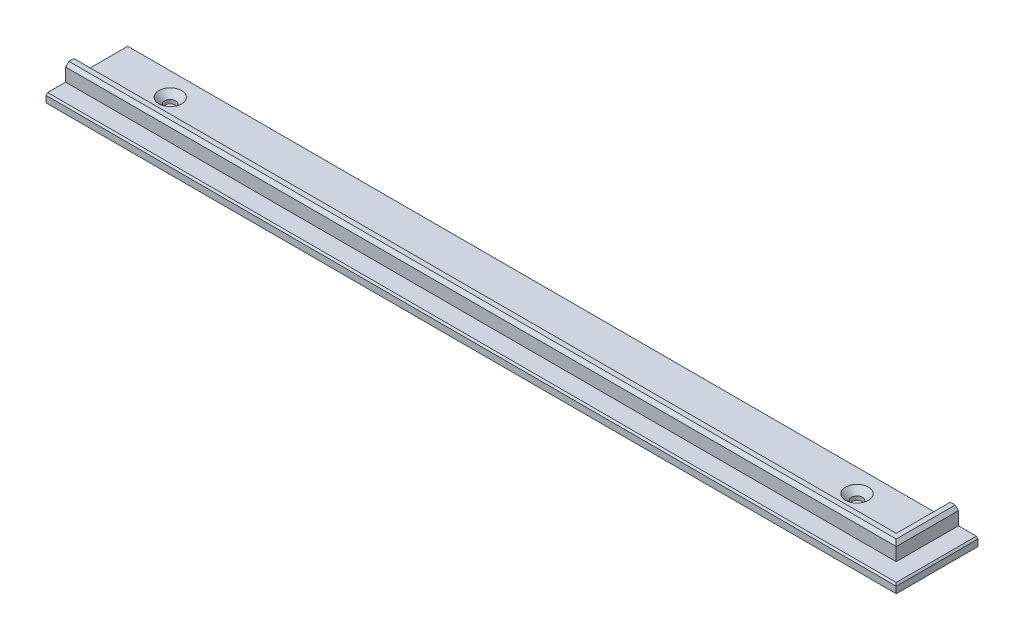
ISO-10303-21;
HEADER;
FILE_DESCRIPTION(('STEP AP214'),'2;1');
FILE_NAME('part.step','',(''),(''),'','','');
FILE_SCHEMA(('AUTOMOTIVE_DESIGN { 1 0 10303 214 1 1 1 1 }'));
ENDSEC;
DATA;
#1=APPLICATION_CONTEXT('core data for automotive mechanical design processes');
#2=APPLICATION_PROTOCOL_DEFINITION('international standard','automotive_design',2000,#1);
#3=PRODUCT_CONTEXT('',#1,'mechanical');
#4=PRODUCT('Part','Part','',(#3));
#5=PRODUCT_RELATED_PRODUCT_CATEGORY('part','',(#4));
#6=PRODUCT_DEFINITION_FORMATION('','',#4);
#7=PRODUCT_DEFINITION_CONTEXT('part definition',#1,'design');
#8=PRODUCT_DEFINITION('design','',#6,#7);
#9=PRODUCT_DEFINITION_SHAPE('','',#8);
#10=(LENGTH_UNIT() NAMED_UNIT(*) SI_UNIT(.MILLI.,.METRE.));
#11=(NAMED_UNIT(*) PLANE_ANGLE_UNIT() SI_UNIT($,.RADIAN.));
#12=(NAMED_UNIT(*) SI_UNIT($,.STERADIAN.) SOLID_ANGLE_UNIT());
#13=UNCERTAINTY_MEASURE_WITH_UNIT(LENGTH_MEASURE(1.E-05),#10,'distance_accuracy_value','');
#14=(GEOMETRIC_REPRESENTATION_CONTEXT(3) GLOBAL_UNCERTAINTY_ASSIGNED_CONTEXT((#13)) GLOBAL_UNIT_ASSIGNED_CONTEXT((#10,
#11,#12)) REPRESENTATION_CONTEXT('',''));
#15=CARTESIAN_POINT('',(0.,0.,0.));
#16=DIRECTION('',(0.,0.,1.));
#17=DIRECTION('',(1.,0.,0.));
#18=AXIS2_PLACEMENT_3D('',#15,#16,#17);
#19=CARTESIAN_POINT('',(0.,3.,0.));
#20=DIRECTION('',(0.,-1.,0.));
#21=DIRECTION('',(0.,0.,-1.));
#22=AXIS2_PLACEMENT_3D('',#19,#20,#21);
#23=PLANE('',#22);
#24=CARTESIAN_POINT('',(100.,3.,-5.5));
#25=DIRECTION('',(0.,1.,0.));
#26=DIRECTION('',(0.,0.,1.));
#27=AXIS2_PLACEMENT_3D('',#24,#25,#26);
#28=CIRCLE('',#27,3.5);
#29=CARTESIAN_POINT('',(100.,3.,-1.99999999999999));
#30=VERTEX_POINT('',#29);
#31=EDGE_CURVE('E402',#30,#30,#28,.T.);
#32=ORIENTED_EDGE('',*,*,#31,.F.);
#33=EDGE_LOOP('',(#32));
#34=FACE_BOUND('',#33,.T.);
#35=CARTESIAN_POINT('',(-110.,3.,-5.5));
#36=DIRECTION('',(0.,1.,0.));
#37=DIRECTION('',(0.,0.,1.));
#38=AXIS2_PLACEMENT_3D('',#35,#36,#37);
#39=CIRCLE('',#38,3.5);
#40=CARTESIAN_POINT('',(-110.,3.,-1.99999999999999));
#41=VERTEX_POINT('',#40);
#42=EDGE_CURVE('E390',#41,#41,#39,.T.);
#43=ORIENTED_EDGE('',*,*,#42,.F.);
#44=EDGE_LOOP('',(#43));
#45=FACE_BOUND('',#44,.T.);
#46=DIRECTION('',(-1.,0.,0.));
#47=VECTOR('',#46,1.);
#48=CARTESIAN_POINT('',(-130.,3.,3.5));
#49=LINE('',#48,#47);
#50=CARTESIAN_POINT('',(121.,3.,3.5));
#51=VERTEX_POINT('',#50);
#52=CARTESIAN_POINT('',(-130.,3.,3.5));
#53=VERTEX_POINT('',#52);
#54=EDGE_CURVE('E193',#51,#53,#49,.T.);
#55=ORIENTED_EDGE('',*,*,#54,.F.);
#56=DIRECTION('',(0.,0.,1.));
#57=VECTOR('',#56,1.);
#58=CARTESIAN_POINT('',(121.,3.,-12.5));
#59=LINE('',#58,#57);
#60=CARTESIAN_POINT('',(121.,3.,-12.5));
#61=VERTEX_POINT('',#60);
#62=EDGE_CURVE('E175',#61,#51,#59,.T.);
#63=ORIENTED_EDGE('',*,*,#62,.F.);
#64=DIRECTION('',(-1.,0.,0.));
#65=VECTOR('',#64,1.);
#66=CARTESIAN_POINT('',(-130.,3.,-12.5));
#67=LINE('',#66,#65);
#68=CARTESIAN_POINT('',(-130.,3.,-12.5));
#69=VERTEX_POINT('',#68);
#70=EDGE_CURVE('E211',#61,#69,#67,.T.);
#71=ORIENTED_EDGE('',*,*,#70,.T.);
#72=DIRECTION('',(0.,0.,1.));
#73=VECTOR('',#72,1.);
#74=CARTESIAN_POINT('',(-130.,3.,12.5));
#75=LINE('',#74,#73);
#76=EDGE_CURVE('E215',#69,#53,#75,.T.);
#77=ORIENTED_EDGE('',*,*,#76,.T.);
#78=EDGE_LOOP('',(#55,#63,#71,#77));
#79=FACE_BOUND('',#78,.T.);
#80=ADVANCED_FACE('F40',(#34,#45,#79),#23,.F.);
#81=CARTESIAN_POINT('',(-130.,3.,6.5));
#82=VERTEX_POINT('',#81);
#83=CARTESIAN_POINT('',(-130.,3.,12.));
#84=VERTEX_POINT('',#83);
#85=EDGE_CURVE('E214',#82,#84,#75,.T.);
#86=ORIENTED_EDGE('',*,*,#85,.T.);
#87=DIRECTION('',(1.,0.,0.));
#88=VECTOR('',#87,1.);
#89=CARTESIAN_POINT('',(0.,3.,12.));
#90=LINE('',#89,#88);
#91=CARTESIAN_POINT('',(129.5,3.,12.));
#92=VERTEX_POINT('',#91);
#93=EDGE_CURVE('E283',#84,#92,#90,.T.);
#94=ORIENTED_EDGE('',*,*,#93,.T.);
#95=DIRECTION('',(0.,0.,-1.));
#96=VECTOR('',#95,1.);
#97=CARTESIAN_POINT('',(129.5,3.,0.));
#98=LINE('',#97,#96);
#99=CARTESIAN_POINT('',(129.5,3.,-12.5));
#100=VERTEX_POINT('',#99);
#101=EDGE_CURVE('E280',#92,#100,#98,.T.);
#102=ORIENTED_EDGE('',*,*,#101,.T.);
#103=CARTESIAN_POINT('',(124.,3.,-12.5));
#104=VERTEX_POINT('',#103);
#105=EDGE_CURVE('E173',#100,#104,#67,.T.);
#106=ORIENTED_EDGE('',*,*,#105,.T.);
#107=DIRECTION('',(0.,0.,-1.));
#108=VECTOR('',#107,1.);
#109=CARTESIAN_POINT('',(124.,3.,-12.5));
#110=LINE('',#109,#108);
#111=CARTESIAN_POINT('',(124.,3.,6.5));
#112=VERTEX_POINT('',#111);
#113=EDGE_CURVE('E159',#112,#104,#110,.T.);
#114=ORIENTED_EDGE('',*,*,#113,.F.);
#115=DIRECTION('',(1.,0.,0.));
#116=VECTOR('',#115,1.);
#117=CARTESIAN_POINT('',(-130.,3.,6.5));
#118=LINE('',#117,#116);
#119=EDGE_CURVE('E170',#82,#112,#118,.T.);
#120=ORIENTED_EDGE('',*,*,#119,.F.);
#121=EDGE_LOOP('',(#86,#94,#102,#106,#114,#120));
#122=FACE_BOUND('',#121,.T.);
#123=ADVANCED_FACE('F169',(#122),#23,.F.);
#124=CARTESIAN_POINT('',(130.,3.,12.5));
#125=DIRECTION('',(-1.,0.,0.));
#126=DIRECTION('',(0.,0.,1.));
#127=AXIS2_PLACEMENT_3D('',#124,#125,#126);
#128=PLANE('',#127);
#129=DIRECTION('',(0.,-1.,0.));
#130=VECTOR('',#129,1.);
#131=CARTESIAN_POINT('',(130.,3.,12.5));
#132=LINE('',#131,#130);
#133=CARTESIAN_POINT('',(130.,2.5,12.5));
#134=VERTEX_POINT('',#133);
#135=CARTESIAN_POINT('',(130.,0.500000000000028,12.5));
#136=VERTEX_POINT('',#135);
#137=EDGE_CURVE('E219',#134,#136,#132,.T.);
#138=ORIENTED_EDGE('',*,*,#137,.T.);
#139=DIRECTION('',(0.,0.,-1.));
#140=VECTOR('',#139,1.);
#141=CARTESIAN_POINT('',(130.,0.500000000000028,-12.5));
#142=LINE('',#141,#140);
#143=CARTESIAN_POINT('',(130.,0.500000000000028,-12.5));
#144=VERTEX_POINT('',#143);
#145=EDGE_CURVE('E277',#136,#144,#142,.T.);
#146=ORIENTED_EDGE('',*,*,#145,.T.);
#147=DIRECTION('',(0.,-1.,0.));
#148=VECTOR('',#147,1.);
#149=CARTESIAN_POINT('',(130.,3.,-12.5));
#150=LINE('',#149,#148);
#151=CARTESIAN_POINT('',(130.,2.5,-12.5));
#152=VERTEX_POINT('',#151);
#153=EDGE_CURVE('E231',#152,#144,#150,.T.);
#154=ORIENTED_EDGE('',*,*,#153,.F.);
#155=DIRECTION('',(0.,0.,1.));
#156=VECTOR('',#155,1.);
#157=CARTESIAN_POINT('',(130.,2.5,12.5));
#158=LINE('',#157,#156);
#159=EDGE_CURVE('E274',#152,#134,#158,.T.);
#160=ORIENTED_EDGE('',*,*,#159,.T.);
#161=EDGE_LOOP('',(#138,#146,#154,#160));
#162=FACE_BOUND('',#161,.T.);
#163=ADVANCED_FACE('F475',(#162),#128,.F.);
#164=CARTESIAN_POINT('',(-130.,3.,-12.5));
#165=DIRECTION('',(0.,0.,1.));
#166=DIRECTION('',(1.,0.,0.));
#167=AXIS2_PLACEMENT_3D('',#164,#165,#166);
#168=PLANE('',#167);
#169=DIRECTION('',(-1.,0.,0.));
#170=VECTOR('',#169,1.);
#171=CARTESIAN_POINT('',(124.,8.,-12.5));
#172=LINE('',#171,#170);
#173=CARTESIAN_POINT('',(123.,8.,-12.5));
#174=VERTEX_POINT('',#173);
#175=CARTESIAN_POINT('',(121.5,8.,-12.5));
#176=VERTEX_POINT('',#175);
#177=EDGE_CURVE('E187',#174,#176,#172,.T.);
#178=ORIENTED_EDGE('',*,*,#177,.F.);
#179=DIRECTION('',(0.707106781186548,-0.707106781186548,0.));
#180=VECTOR('',#179,1.);
#181=CARTESIAN_POINT('',(123.,8.,-12.5));
#182=LINE('',#181,#180);
#183=CARTESIAN_POINT('',(124.,7.,-12.5));
#184=VERTEX_POINT('',#183);
#185=EDGE_CURVE('E322',#174,#184,#182,.T.);
#186=ORIENTED_EDGE('',*,*,#185,.T.);
#187=DIRECTION('',(0.,-1.,0.));
#188=VECTOR('',#187,1.);
#189=CARTESIAN_POINT('',(124.,8.,-12.5));
#190=LINE('',#189,#188);
#191=EDGE_CURVE('E163',#184,#104,#190,.T.);
#192=ORIENTED_EDGE('',*,*,#191,.T.);
#193=ORIENTED_EDGE('',*,*,#105,.F.);
#194=DIRECTION('',(-0.707106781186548,0.707106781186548,0.));
#195=VECTOR('',#194,1.);
#196=CARTESIAN_POINT('',(129.5,3.,-12.5));
#197=LINE('',#196,#195);
#198=EDGE_CURVE('E239',#100,#152,#197,.F.);
#199=ORIENTED_EDGE('',*,*,#198,.T.);
#200=ORIENTED_EDGE('',*,*,#153,.T.);
#201=DIRECTION('',(-1.,0.,0.));
#202=VECTOR('',#201,1.);
#203=CARTESIAN_POINT('',(-130.,0.500000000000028,-12.5));
#204=LINE('',#203,#202);
#205=CARTESIAN_POINT('',(-130.,0.500000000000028,-12.5));
#206=VERTEX_POINT('',#205);
#207=EDGE_CURVE('E242',#144,#206,#204,.T.);
#208=ORIENTED_EDGE('',*,*,#207,.T.);
#209=DIRECTION('',(0.,-1.,0.));
#210=VECTOR('',#209,1.);
#211=CARTESIAN_POINT('',(-130.,3.,-12.5));
#212=LINE('',#211,#210);
#213=EDGE_CURVE('E227',#69,#206,#212,.T.);
#214=ORIENTED_EDGE('',*,*,#213,.F.);
#215=ORIENTED_EDGE('',*,*,#70,.F.);
#216=DIRECTION('',(0.,-1.,0.));
#217=VECTOR('',#216,1.);
#218=CARTESIAN_POINT('',(121.,8.,-12.5));
#219=LINE('',#218,#217);
#220=CARTESIAN_POINT('',(121.,7.49999999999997,-12.5));
#221=VERTEX_POINT('',#220);
#222=EDGE_CURVE('E204',#221,#61,#219,.T.);
#223=ORIENTED_EDGE('',*,*,#222,.F.);
#224=DIRECTION('',(0.707106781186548,0.707106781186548,0.));
#225=VECTOR('',#224,1.);
#226=CARTESIAN_POINT('',(121.5,8.,-12.5));
#227=LINE('',#226,#225);
#228=EDGE_CURVE('E235',#221,#176,#227,.T.);
#229=ORIENTED_EDGE('',*,*,#228,.T.);
#230=EDGE_LOOP('',(#178,#186,#192,#193,#199,#200,#208,#214,#215,#223,#229));
#231=FACE_BOUND('',#230,.T.);
#232=ADVANCED_FACE('F429',(#231),#168,.F.);
#233=CARTESIAN_POINT('',(-130.,3.,12.5));
#234=DIRECTION('',(1.,0.,0.));
#235=DIRECTION('',(0.,0.,-1.));
#236=AXIS2_PLACEMENT_3D('',#233,#234,#235);
#237=PLANE('',#236);
#238=DIRECTION('',(0.,-1.,0.));
#239=VECTOR('',#238,1.);
#240=CARTESIAN_POINT('',(-130.,8.,6.5));
#241=LINE('',#240,#239);
#242=CARTESIAN_POINT('',(-130.,7.,6.5));
#243=VERTEX_POINT('',#242);
#244=EDGE_CURVE('E162',#243,#82,#241,.T.);
#245=ORIENTED_EDGE('',*,*,#244,.F.);
#246=DIRECTION('',(0.,0.707106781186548,-0.707106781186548));
#247=VECTOR('',#246,1.);
#248=CARTESIAN_POINT('',(-130.,8.,5.5));
#249=LINE('',#248,#247);
#250=CARTESIAN_POINT('',(-130.,8.,5.5));
#251=VERTEX_POINT('',#250);
#252=EDGE_CURVE('E11',#243,#251,#249,.T.);
#253=ORIENTED_EDGE('',*,*,#252,.T.);
#254=DIRECTION('',(0.,0.,1.));
#255=VECTOR('',#254,1.);
#256=CARTESIAN_POINT('',(-130.,8.,3.5));
#257=LINE('',#256,#255);
#258=CARTESIAN_POINT('',(-130.,8.,4.00000000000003));
#259=VERTEX_POINT('',#258);
#260=EDGE_CURVE('E197',#259,#251,#257,.T.);
#261=ORIENTED_EDGE('',*,*,#260,.F.);
#262=DIRECTION('',(0.,-0.707106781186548,-0.707106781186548));
#263=VECTOR('',#262,1.);
#264=CARTESIAN_POINT('',(-130.,8.,4.00000000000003));
#265=LINE('',#264,#263);
#266=CARTESIAN_POINT('',(-130.,7.49999999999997,3.5));
#267=VERTEX_POINT('',#266);
#268=EDGE_CURVE('E259',#259,#267,#265,.T.);
#269=ORIENTED_EDGE('',*,*,#268,.T.);
#270=DIRECTION('',(0.,-1.,0.));
#271=VECTOR('',#270,1.);
#272=CARTESIAN_POINT('',(-130.,8.,3.5));
#273=LINE('',#272,#271);
#274=EDGE_CURVE('E198',#267,#53,#273,.T.);
#275=ORIENTED_EDGE('',*,*,#274,.T.);
#276=ORIENTED_EDGE('',*,*,#76,.F.);
#277=ORIENTED_EDGE('',*,*,#213,.T.);
#278=DIRECTION('',(0.,0.,1.));
#279=VECTOR('',#278,1.);
#280=CARTESIAN_POINT('',(-130.,0.500000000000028,12.5));
#281=LINE('',#280,#279);
#282=CARTESIAN_POINT('',(-130.,0.500000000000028,12.5));
#283=VERTEX_POINT('',#282);
#284=EDGE_CURVE('E265',#206,#283,#281,.T.);
#285=ORIENTED_EDGE('',*,*,#284,.T.);
#286=DIRECTION('',(0.,-1.,0.));
#287=VECTOR('',#286,1.);
#288=CARTESIAN_POINT('',(-130.,3.,12.5));
#289=LINE('',#288,#287);
#290=CARTESIAN_POINT('',(-130.,2.5,12.5));
#291=VERTEX_POINT('',#290);
#292=EDGE_CURVE('E223',#291,#283,#289,.T.);
#293=ORIENTED_EDGE('',*,*,#292,.F.);
#294=DIRECTION('',(0.,-0.707106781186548,0.707106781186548));
#295=VECTOR('',#294,1.);
#296=CARTESIAN_POINT('',(-130.,3.,12.));
#297=LINE('',#296,#295);
#298=EDGE_CURVE('E262',#291,#84,#297,.F.);
#299=ORIENTED_EDGE('',*,*,#298,.T.);
#300=ORIENTED_EDGE('',*,*,#85,.F.);
#301=EDGE_LOOP('',(#245,#253,#261,#269,#275,#276,#277,#285,#293,#299,#300));
#302=FACE_BOUND('',#301,.T.);
#303=ADVANCED_FACE('F458',(#302),#237,.F.);
#304=CARTESIAN_POINT('',(-130.,3.,12.5));
#305=DIRECTION('',(0.,0.,-1.));
#306=DIRECTION('',(-1.,0.,0.));
#307=AXIS2_PLACEMENT_3D('',#304,#305,#306);
#308=PLANE('',#307);
#309=ORIENTED_EDGE('',*,*,#292,.T.);
#310=DIRECTION('',(1.,0.,0.));
#311=VECTOR('',#310,1.);
#312=CARTESIAN_POINT('',(130.,0.500000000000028,12.5));
#313=LINE('',#312,#311);
#314=EDGE_CURVE('E271',#283,#136,#313,.T.);
#315=ORIENTED_EDGE('',*,*,#314,.T.);
#316=ORIENTED_EDGE('',*,*,#137,.F.);
#317=DIRECTION('',(-1.,0.,0.));
#318=VECTOR('',#317,1.);
#319=CARTESIAN_POINT('',(-130.,2.5,12.5));
#320=LINE('',#319,#318);
#321=EDGE_CURVE('E268',#134,#291,#320,.T.);
#322=ORIENTED_EDGE('',*,*,#321,.T.);
#323=EDGE_LOOP('',(#309,#315,#316,#322));
#324=FACE_BOUND('',#323,.T.);
#325=ADVANCED_FACE('F630',(#324),#308,.F.);
#326=CARTESIAN_POINT('',(0.,0.,0.));
#327=DIRECTION('',(0.,-1.,0.));
#328=DIRECTION('',(0.,0.,-1.));
#329=AXIS2_PLACEMENT_3D('',#326,#327,#328);
#330=PLANE('',#329);
#331=CARTESIAN_POINT('',(100.,0.,-5.5));
#332=DIRECTION('',(0.,1.,0.));
#333=DIRECTION('',(0.,0.,1.));
#334=AXIS2_PLACEMENT_3D('',#331,#332,#333);
#335=CIRCLE('',#334,1.69999999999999);
#336=CARTESIAN_POINT('',(100.,0.,-3.8));
#337=VERTEX_POINT('',#336);
#338=EDGE_CURVE('E394',#337,#337,#335,.T.);
#339=ORIENTED_EDGE('',*,*,#338,.T.);
#340=EDGE_LOOP('',(#339));
#341=FACE_BOUND('',#340,.T.);
#342=CARTESIAN_POINT('',(-110.,0.,-5.5));
#343=DIRECTION('',(0.,1.,0.));
#344=DIRECTION('',(0.,0.,1.));
#345=AXIS2_PLACEMENT_3D('',#342,#343,#344);
#346=CIRCLE('',#345,1.69999999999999);
#347=CARTESIAN_POINT('',(-110.,0.,-3.8));
#348=VERTEX_POINT('',#347);
#349=EDGE_CURVE('E382',#348,#348,#346,.T.);
#350=ORIENTED_EDGE('',*,*,#349,.T.);
#351=EDGE_LOOP('',(#350));
#352=FACE_BOUND('',#351,.T.);
#353=DIRECTION('',(0.,0.,-1.));
#354=VECTOR('',#353,1.);
#355=CARTESIAN_POINT('',(-129.5,0.,-12.5));
#356=LINE('',#355,#354);
#357=CARTESIAN_POINT('',(-129.5,0.,12.));
#358=VERTEX_POINT('',#357);
#359=CARTESIAN_POINT('',(-129.5,0.,-12.));
#360=VERTEX_POINT('',#359);
#361=EDGE_CURVE('E252',#358,#360,#356,.T.);
#362=ORIENTED_EDGE('',*,*,#361,.T.);
#363=DIRECTION('',(1.,0.,0.));
#364=VECTOR('',#363,1.);
#365=CARTESIAN_POINT('',(130.,0.,-12.));
#366=LINE('',#365,#364);
#367=CARTESIAN_POINT('',(129.5,0.,-12.));
#368=VERTEX_POINT('',#367);
#369=EDGE_CURVE('E255',#360,#368,#366,.T.);
#370=ORIENTED_EDGE('',*,*,#369,.T.);
#371=DIRECTION('',(0.,0.,1.));
#372=VECTOR('',#371,1.);
#373=CARTESIAN_POINT('',(129.5,0.,12.5));
#374=LINE('',#373,#372);
#375=CARTESIAN_POINT('',(129.5,0.,12.));
#376=VERTEX_POINT('',#375);
#377=EDGE_CURVE('E246',#368,#376,#374,.T.);
#378=ORIENTED_EDGE('',*,*,#377,.T.);
#379=DIRECTION('',(-1.,0.,0.));
#380=VECTOR('',#379,1.);
#381=CARTESIAN_POINT('',(-130.,0.,12.));
#382=LINE('',#381,#380);
#383=EDGE_CURVE('E249',#376,#358,#382,.T.);
#384=ORIENTED_EDGE('',*,*,#383,.T.);
#385=EDGE_LOOP('',(#362,#370,#378,#384));
#386=FACE_BOUND('',#385,.T.);
#387=ADVANCED_FACE('F620',(#341,#352,#386),#330,.T.);
#388=CARTESIAN_POINT('',(-130.,8.,6.5));
#389=DIRECTION('',(0.,0.,-1.));
#390=DIRECTION('',(-1.,0.,0.));
#391=AXIS2_PLACEMENT_3D('',#388,#389,#390);
#392=PLANE('',#391);
#393=DIRECTION('',(0.,-1.,0.));
#394=VECTOR('',#393,1.);
#395=CARTESIAN_POINT('',(124.,8.,6.5));
#396=LINE('',#395,#394);
#397=CARTESIAN_POINT('',(124.,7.,6.5));
#398=VERTEX_POINT('',#397);
#399=EDGE_CURVE('E156',#398,#112,#396,.T.);
#400=ORIENTED_EDGE('',*,*,#399,.F.);
#401=DIRECTION('',(-1.,0.,0.));
#402=VECTOR('',#401,1.);
#403=CARTESIAN_POINT('',(-130.,7.,6.5));
#404=LINE('',#403,#402);
#405=EDGE_CURVE('E51',#398,#243,#404,.T.);
#406=ORIENTED_EDGE('',*,*,#405,.T.);
#407=ORIENTED_EDGE('',*,*,#244,.T.);
#408=ORIENTED_EDGE('',*,*,#119,.T.);
#409=EDGE_LOOP('',(#400,#406,#407,#408));
#410=FACE_BOUND('',#409,.T.);
#411=ADVANCED_FACE('F177',(#410),#392,.F.);
#412=CARTESIAN_POINT('',(124.,8.,-12.5));
#413=DIRECTION('',(-1.,0.,0.));
#414=DIRECTION('',(0.,0.,1.));
#415=AXIS2_PLACEMENT_3D('',#412,#413,#414);
#416=PLANE('',#415);
#417=ORIENTED_EDGE('',*,*,#191,.F.);
#418=DIRECTION('',(0.,0.,1.));
#419=VECTOR('',#418,1.);
#420=CARTESIAN_POINT('',(124.,7.,6.5));
#421=LINE('',#420,#419);
#422=EDGE_CURVE('E65',#184,#398,#421,.T.);
#423=ORIENTED_EDGE('',*,*,#422,.T.);
#424=ORIENTED_EDGE('',*,*,#399,.T.);
#425=ORIENTED_EDGE('',*,*,#113,.T.);
#426=EDGE_LOOP('',(#417,#423,#424,#425));
#427=FACE_BOUND('',#426,.T.);
#428=ADVANCED_FACE('F158',(#427),#416,.F.);
#429=CARTESIAN_POINT('',(121.,8.,-12.5));
#430=DIRECTION('',(1.,0.,0.));
#431=DIRECTION('',(0.,0.,-1.));
#432=AXIS2_PLACEMENT_3D('',#429,#430,#431);
#433=PLANE('',#432);
#434=DIRECTION('',(0.,-1.,0.));
#435=VECTOR('',#434,1.);
#436=CARTESIAN_POINT('',(121.,8.,3.5));
#437=LINE('',#436,#435);
#438=CARTESIAN_POINT('',(121.,7.49999999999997,3.5));
#439=VERTEX_POINT('',#438);
#440=EDGE_CURVE('E201',#439,#51,#437,.T.);
#441=ORIENTED_EDGE('',*,*,#440,.F.);
#442=DIRECTION('',(0.,0.,-1.));
#443=VECTOR('',#442,1.);
#444=CARTESIAN_POINT('',(121.,7.49999999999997,-12.5));
#445=LINE('',#444,#443);
#446=EDGE_CURVE('E294',#439,#221,#445,.T.);
#447=ORIENTED_EDGE('',*,*,#446,.T.);
#448=ORIENTED_EDGE('',*,*,#222,.T.);
#449=ORIENTED_EDGE('',*,*,#62,.T.);
#450=EDGE_LOOP('',(#441,#447,#448,#449));
#451=FACE_BOUND('',#450,.T.);
#452=ADVANCED_FACE('F423',(#451),#433,.F.);
#453=CARTESIAN_POINT('',(-130.,8.,3.5));
#454=DIRECTION('',(0.,0.,1.));
#455=DIRECTION('',(1.,0.,0.));
#456=AXIS2_PLACEMENT_3D('',#453,#454,#455);
#457=PLANE('',#456);
#458=ORIENTED_EDGE('',*,*,#274,.F.);
#459=DIRECTION('',(1.,0.,0.));
#460=VECTOR('',#459,1.);
#461=CARTESIAN_POINT('',(121.,7.49999999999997,3.5));
#462=LINE('',#461,#460);
#463=EDGE_CURVE('E297',#267,#439,#462,.T.);
#464=ORIENTED_EDGE('',*,*,#463,.T.);
#465=ORIENTED_EDGE('',*,*,#440,.T.);
#466=ORIENTED_EDGE('',*,*,#54,.T.);
#467=EDGE_LOOP('',(#458,#464,#465,#466));
#468=FACE_BOUND('',#467,.T.);
#469=ADVANCED_FACE('F489',(#468),#457,.F.);
#470=CARTESIAN_POINT('',(0.,8.,0.));
#471=DIRECTION('',(0.,1.,0.));
#472=DIRECTION('',(0.,0.,1.));
#473=AXIS2_PLACEMENT_3D('',#470,#471,#472);
#474=PLANE('',#473);
#475=DIRECTION('',(1.,0.,0.));
#476=VECTOR('',#475,1.);
#477=CARTESIAN_POINT('',(124.,8.,5.5));
#478=LINE('',#477,#476);
#479=CARTESIAN_POINT('',(123.,8.,5.5));
#480=VERTEX_POINT('',#479);
#481=EDGE_CURVE('E300',#251,#480,#478,.T.);
#482=ORIENTED_EDGE('',*,*,#481,.T.);
#483=DIRECTION('',(0.,0.,-1.));
#484=VECTOR('',#483,1.);
#485=CARTESIAN_POINT('',(123.,8.,-12.5));
#486=LINE('',#485,#484);
#487=EDGE_CURVE('E318',#480,#174,#486,.T.);
#488=ORIENTED_EDGE('',*,*,#487,.T.);
#489=ORIENTED_EDGE('',*,*,#177,.T.);
#490=DIRECTION('',(0.,0.,1.));
#491=VECTOR('',#490,1.);
#492=CARTESIAN_POINT('',(121.5,8.,3.5));
#493=LINE('',#492,#491);
#494=CARTESIAN_POINT('',(121.5,8.,4.00000000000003));
#495=VERTEX_POINT('',#494);
#496=EDGE_CURVE('E290',#176,#495,#493,.T.);
#497=ORIENTED_EDGE('',*,*,#496,.T.);
#498=DIRECTION('',(-1.,0.,0.));
#499=VECTOR('',#498,1.);
#500=CARTESIAN_POINT('',(-130.,8.,4.00000000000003));
#501=LINE('',#500,#499);
#502=EDGE_CURVE('E287',#495,#259,#501,.T.);
#503=ORIENTED_EDGE('',*,*,#502,.T.);
#504=ORIENTED_EDGE('',*,*,#260,.T.);
#505=EDGE_LOOP('',(#482,#488,#489,#497,#503,#504));
#506=FACE_BOUND('',#505,.T.);
#507=ADVANCED_FACE('F436',(#506),#474,.T.);
#508=CARTESIAN_POINT('',(-130.,0.500000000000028,12.5));
#509=DIRECTION('',(0.,-0.707106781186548,0.707106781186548));
#510=DIRECTION('',(-1.,0.,0.));
#511=AXIS2_PLACEMENT_3D('',#508,#509,#510);
#512=PLANE('',#511);
#513=DIRECTION('',(0.577350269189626,-0.577350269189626,-0.577350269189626));
#514=VECTOR('',#513,1.);
#515=CARTESIAN_POINT('',(-130.,0.500000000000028,12.5));
#516=LINE('',#515,#514);
#517=EDGE_CURVE('E184',#358,#283,#516,.F.);
#518=ORIENTED_EDGE('',*,*,#517,.F.);
#519=ORIENTED_EDGE('',*,*,#383,.F.);
#520=DIRECTION('',(-0.577350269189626,-0.577350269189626,-0.577350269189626));
#521=VECTOR('',#520,1.);
#522=CARTESIAN_POINT('',(130.,0.500000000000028,12.5));
#523=LINE('',#522,#521);
#524=EDGE_CURVE('E179',#136,#376,#523,.T.);
#525=ORIENTED_EDGE('',*,*,#524,.F.);
#526=ORIENTED_EDGE('',*,*,#314,.F.);
#527=EDGE_LOOP('',(#518,#519,#525,#526));
#528=FACE_BOUND('',#527,.T.);
#529=ADVANCED_FACE('F569',(#528),#512,.T.);
#530=CARTESIAN_POINT('',(130.,0.500000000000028,12.5));
#531=DIRECTION('',(0.707106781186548,-0.707106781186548,0.));
#532=DIRECTION('',(0.,0.,1.));
#533=AXIS2_PLACEMENT_3D('',#530,#531,#532);
#534=PLANE('',#533);
#535=ORIENTED_EDGE('',*,*,#524,.T.);
#536=ORIENTED_EDGE('',*,*,#377,.F.);
#537=DIRECTION('',(0.577350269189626,0.577350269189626,-0.577350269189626));
#538=VECTOR('',#537,1.);
#539=CARTESIAN_POINT('',(121.666666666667,-7.8333333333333,-4.16666666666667));
#540=LINE('',#539,#538);
#541=EDGE_CURVE('E304',#144,#368,#540,.F.);
#542=ORIENTED_EDGE('',*,*,#541,.F.);
#543=ORIENTED_EDGE('',*,*,#145,.F.);
#544=EDGE_LOOP('',(#535,#536,#542,#543));
#545=FACE_BOUND('',#544,.T.);
#546=ADVANCED_FACE('F480',(#545),#534,.T.);
#547=CARTESIAN_POINT('',(-130.,0.500000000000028,12.5));
#548=DIRECTION('',(-0.707106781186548,-0.707106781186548,0.));
#549=DIRECTION('',(0.,0.,-1.));
#550=AXIS2_PLACEMENT_3D('',#547,#548,#549);
#551=PLANE('',#550);
#552=ORIENTED_EDGE('',*,*,#517,.T.);
#553=ORIENTED_EDGE('',*,*,#284,.F.);
#554=DIRECTION('',(0.577350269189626,-0.577350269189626,0.577350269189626));
#555=VECTOR('',#554,1.);
#556=CARTESIAN_POINT('',(-121.666666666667,-7.8333333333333,-4.16666666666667));
#557=LINE('',#556,#555);
#558=EDGE_CURVE('E301',#360,#206,#557,.F.);
#559=ORIENTED_EDGE('',*,*,#558,.F.);
#560=ORIENTED_EDGE('',*,*,#361,.F.);
#561=EDGE_LOOP('',(#552,#553,#559,#560));
#562=FACE_BOUND('',#561,.T.);
#563=ADVANCED_FACE('F551',(#562),#551,.T.);
#564=CARTESIAN_POINT('',(-130.,0.500000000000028,-12.5));
#565=DIRECTION('',(0.,-0.707106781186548,-0.707106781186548));
#566=DIRECTION('',(1.,0.,0.));
#567=AXIS2_PLACEMENT_3D('',#564,#565,#566);
#568=PLANE('',#567);
#569=ORIENTED_EDGE('',*,*,#541,.T.);
#570=ORIENTED_EDGE('',*,*,#369,.F.);
#571=ORIENTED_EDGE('',*,*,#558,.T.);
#572=ORIENTED_EDGE('',*,*,#207,.F.);
#573=EDGE_LOOP('',(#569,#570,#571,#572));
#574=FACE_BOUND('',#573,.T.);
#575=ADVANCED_FACE('F485',(#574),#568,.T.);
#576=CARTESIAN_POINT('',(129.5,3.,0.));
#577=DIRECTION('',(-0.707106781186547,-0.707106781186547,0.));
#578=DIRECTION('',(0.,0.,-1.));
#579=AXIS2_PLACEMENT_3D('',#576,#577,#578);
#580=PLANE('',#579);
#581=ORIENTED_EDGE('',*,*,#198,.F.);
#582=ORIENTED_EDGE('',*,*,#101,.F.);
#583=DIRECTION('',(0.577350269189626,-0.577350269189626,0.577350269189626));
#584=VECTOR('',#583,1.);
#585=CARTESIAN_POINT('',(125.5,7.,8.));
#586=LINE('',#585,#584);
#587=EDGE_CURVE('E305',#134,#92,#586,.F.);
#588=ORIENTED_EDGE('',*,*,#587,.F.);
#589=ORIENTED_EDGE('',*,*,#159,.F.);
#590=EDGE_LOOP('',(#581,#582,#588,#589));
#591=FACE_BOUND('',#590,.T.);
#592=ADVANCED_FACE('F471',(#591),#580,.F.);
#593=CARTESIAN_POINT('',(0.,3.,12.));
#594=DIRECTION('',(0.,-0.707106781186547,-0.707106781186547));
#595=DIRECTION('',(1.,0.,0.));
#596=AXIS2_PLACEMENT_3D('',#593,#594,#595);
#597=PLANE('',#596);
#598=ORIENTED_EDGE('',*,*,#298,.F.);
#599=ORIENTED_EDGE('',*,*,#321,.F.);
#600=ORIENTED_EDGE('',*,*,#587,.T.);
#601=ORIENTED_EDGE('',*,*,#93,.F.);
#602=EDGE_LOOP('',(#598,#599,#600,#601));
#603=FACE_BOUND('',#602,.T.);
#604=ADVANCED_FACE('F464',(#603),#597,.F.);
#605=CARTESIAN_POINT('',(0.,8.,4.00000000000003));
#606=DIRECTION('',(0.,0.707106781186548,-0.707106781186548));
#607=DIRECTION('',(1.,0.,0.));
#608=AXIS2_PLACEMENT_3D('',#605,#606,#607);
#609=PLANE('',#608);
#610=ORIENTED_EDGE('',*,*,#268,.F.);
#611=ORIENTED_EDGE('',*,*,#502,.F.);
#612=DIRECTION('',(-0.577350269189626,-0.577350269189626,-0.577350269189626));
#613=VECTOR('',#612,1.);
#614=CARTESIAN_POINT('',(120.166666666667,6.66666666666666,2.66666666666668));
#615=LINE('',#614,#613);
#616=EDGE_CURVE('E313',#439,#495,#615,.F.);
#617=ORIENTED_EDGE('',*,*,#616,.F.);
#618=ORIENTED_EDGE('',*,*,#463,.F.);
#619=EDGE_LOOP('',(#610,#611,#617,#618));
#620=FACE_BOUND('',#619,.T.);
#621=ADVANCED_FACE('F491',(#620),#609,.T.);
#622=CARTESIAN_POINT('',(121.5,8.,0.));
#623=DIRECTION('',(-0.707106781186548,0.707106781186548,0.));
#624=DIRECTION('',(0.,0.,-1.));
#625=AXIS2_PLACEMENT_3D('',#622,#623,#624);
#626=PLANE('',#625);
#627=ORIENTED_EDGE('',*,*,#228,.F.);
#628=ORIENTED_EDGE('',*,*,#446,.F.);
#629=ORIENTED_EDGE('',*,*,#616,.T.);
#630=ORIENTED_EDGE('',*,*,#496,.F.);
#631=EDGE_LOOP('',(#627,#628,#629,#630));
#632=FACE_BOUND('',#631,.T.);
#633=ADVANCED_FACE('F433',(#632),#626,.T.);
#634=CARTESIAN_POINT('',(0.,8.,5.5));
#635=DIRECTION('',(0.,0.707106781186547,0.707106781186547));
#636=DIRECTION('',(-1.,0.,0.));
#637=AXIS2_PLACEMENT_3D('',#634,#635,#636);
#638=PLANE('',#637);
#639=ORIENTED_EDGE('',*,*,#252,.F.);
#640=ORIENTED_EDGE('',*,*,#405,.F.);
#641=DIRECTION('',(-0.577350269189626,0.577350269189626,-0.577350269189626));
#642=VECTOR('',#641,1.);
#643=CARTESIAN_POINT('',(82.,49.,-35.5));
#644=LINE('',#643,#642);
#645=EDGE_CURVE('E45',#480,#398,#644,.F.);
#646=ORIENTED_EDGE('',*,*,#645,.F.);
#647=ORIENTED_EDGE('',*,*,#481,.F.);
#648=EDGE_LOOP('',(#639,#640,#646,#647));
#649=FACE_BOUND('',#648,.T.);
#650=ADVANCED_FACE('F43',(#649),#638,.T.);
#651=CARTESIAN_POINT('',(123.,8.,0.));
#652=DIRECTION('',(0.707106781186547,0.707106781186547,0.));
#653=DIRECTION('',(0.,0.,1.));
#654=AXIS2_PLACEMENT_3D('',#651,#652,#653);
#655=PLANE('',#654);
#656=ORIENTED_EDGE('',*,*,#645,.T.);
#657=ORIENTED_EDGE('',*,*,#422,.F.);
#658=ORIENTED_EDGE('',*,*,#185,.F.);
#659=ORIENTED_EDGE('',*,*,#487,.F.);
#660=EDGE_LOOP('',(#656,#657,#658,#659));
#661=FACE_BOUND('',#660,.T.);
#662=ADVANCED_FACE('F440',(#661),#655,.T.);
#663=CARTESIAN_POINT('',(-110.,3.,-5.5));
#664=DIRECTION('',(0.,1.,0.));
#665=DIRECTION('',(0.,0.,1.));
#666=AXIS2_PLACEMENT_3D('',#663,#664,#665);
#667=CYLINDRICAL_SURFACE('',#666,1.69999999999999);
#668=ORIENTED_EDGE('',*,*,#349,.F.);
#669=EDGE_LOOP('',(#668));
#670=FACE_BOUND('',#669,.T.);
#671=CARTESIAN_POINT('',(-110.,1.19999999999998,-5.5));
#672=DIRECTION('',(0.,1.,0.));
#673=DIRECTION('',(0.,0.,1.));
#674=AXIS2_PLACEMENT_3D('',#671,#672,#673);
#675=CIRCLE('',#674,1.69999999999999);
#676=CARTESIAN_POINT('',(-110.,1.19999999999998,-3.8));
#677=VERTEX_POINT('',#676);
#678=EDGE_CURVE('E386',#677,#677,#675,.T.);
#679=ORIENTED_EDGE('',*,*,#678,.T.);
#680=EDGE_LOOP('',(#679));
#681=FACE_BOUND('',#680,.T.);
#682=ADVANCED_FACE('F510',(#670,#681),#667,.F.);
#683=CARTESIAN_POINT('',(-110.,3.,-5.5));
#684=DIRECTION('',(0.,1.,0.));
#685=DIRECTION('',(0.,0.,1.));
#686=AXIS2_PLACEMENT_3D('',#683,#684,#685);
#687=CONICAL_SURFACE('',#686,3.5,0.785398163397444);
#688=ORIENTED_EDGE('',*,*,#678,.F.);
#689=EDGE_LOOP('',(#688));
#690=FACE_BOUND('',#689,.T.);
#691=ORIENTED_EDGE('',*,*,#42,.T.);
#692=EDGE_LOOP('',(#691));
#693=FACE_BOUND('',#692,.T.);
#694=ADVANCED_FACE('F515',(#690,#693),#687,.F.);
#695=CARTESIAN_POINT('',(100.,3.,-5.5));
#696=DIRECTION('',(0.,1.,0.));
#697=DIRECTION('',(0.,0.,1.));
#698=AXIS2_PLACEMENT_3D('',#695,#696,#697);
#699=CYLINDRICAL_SURFACE('',#698,1.69999999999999);
#700=ORIENTED_EDGE('',*,*,#338,.F.);
#701=EDGE_LOOP('',(#700));
#702=FACE_BOUND('',#701,.T.);
#703=CARTESIAN_POINT('',(100.,1.19999999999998,-5.5));
#704=DIRECTION('',(0.,1.,0.));
#705=DIRECTION('',(0.,0.,1.));
#706=AXIS2_PLACEMENT_3D('',#703,#704,#705);
#707=CIRCLE('',#706,1.69999999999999);
#708=CARTESIAN_POINT('',(100.,1.19999999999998,-3.8));
#709=VERTEX_POINT('',#708);
#710=EDGE_CURVE('E398',#709,#709,#707,.T.);
#711=ORIENTED_EDGE('',*,*,#710,.T.);
#712=EDGE_LOOP('',(#711));
#713=FACE_BOUND('',#712,.T.);
#714=ADVANCED_FACE('F748',(#702,#713),#699,.F.);
#715=CARTESIAN_POINT('',(100.,3.,-5.5));
#716=DIRECTION('',(0.,1.,0.));
#717=DIRECTION('',(0.,0.,1.));
#718=AXIS2_PLACEMENT_3D('',#715,#716,#717);
#719=CONICAL_SURFACE('',#718,3.5,0.785398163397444);
#720=ORIENTED_EDGE('',*,*,#710,.F.);
#721=EDGE_LOOP('',(#720));
#722=FACE_BOUND('',#721,.T.);
#723=ORIENTED_EDGE('',*,*,#31,.T.);
#724=EDGE_LOOP('',(#723));
#725=FACE_BOUND('',#724,.T.);
#726=ADVANCED_FACE('F408',(#722,#725),#719,.F.);
#727=CLOSED_SHELL('',(#80,#123,#163,#232,#303,#325,#387,#411,#428,#452,#469,#507,#529,#546,#563,
#575,#592,#604,#621,#633,#650,#662,#682,#694,#714,#726));
#728=MANIFOLD_SOLID_BREP('B2',#727);
#729=ADVANCED_BREP_SHAPE_REPRESENTATION('',(#18,#728),#14);
#730=SHAPE_DEFINITION_REPRESENTATION(#9,#729);
ENDSEC;
END-ISO-10303-21;
